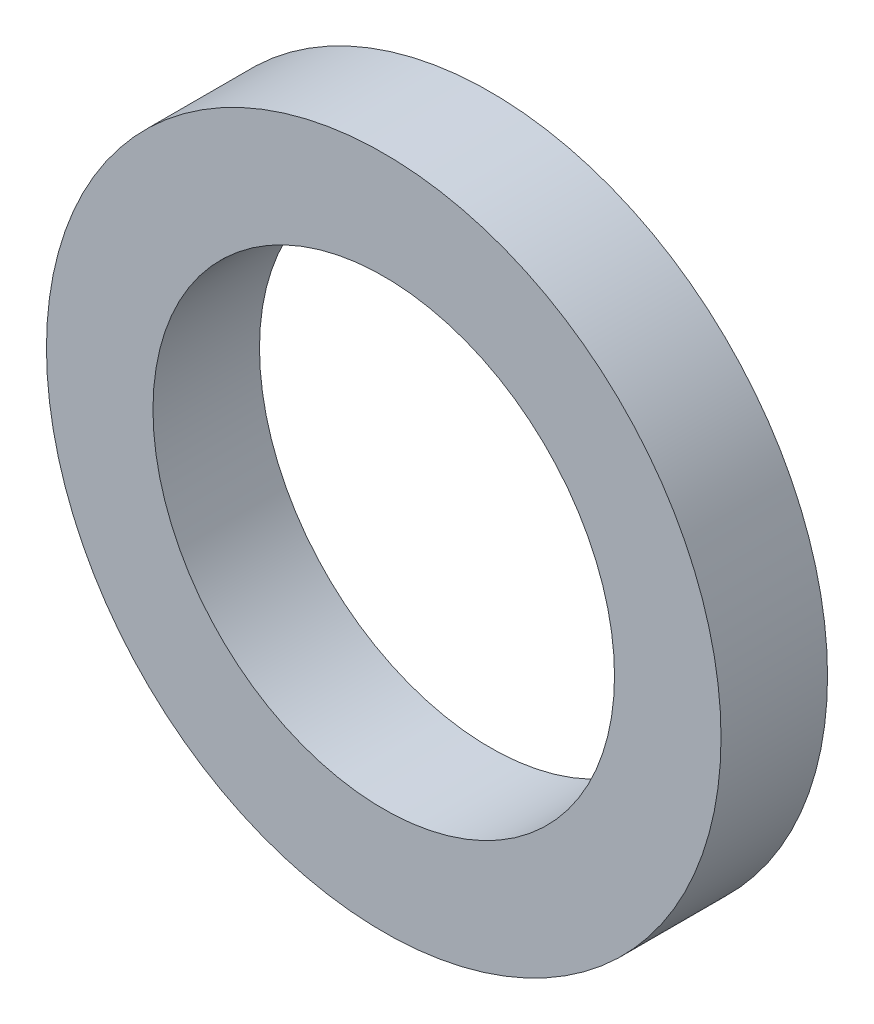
ISO-10303-21;
HEADER;
FILE_DESCRIPTION(('STEP AP214'),'2;1');
FILE_NAME('part.step','',(''),(''),'','','');
FILE_SCHEMA(('AUTOMOTIVE_DESIGN { 1 0 10303 214 1 1 1 1 }'));
ENDSEC;
DATA;
#1=APPLICATION_CONTEXT('core data for automotive mechanical design processes');
#2=APPLICATION_PROTOCOL_DEFINITION('international standard','automotive_design',2000,#1);
#3=PRODUCT_CONTEXT('',#1,'mechanical');
#4=PRODUCT('Part','Part','',(#3));
#5=PRODUCT_RELATED_PRODUCT_CATEGORY('part','',(#4));
#6=PRODUCT_DEFINITION_FORMATION('','',#4);
#7=PRODUCT_DEFINITION_CONTEXT('part definition',#1,'design');
#8=PRODUCT_DEFINITION('design','',#6,#7);
#9=PRODUCT_DEFINITION_SHAPE('','',#8);
#10=(LENGTH_UNIT() NAMED_UNIT(*) SI_UNIT(.MILLI.,.METRE.));
#11=(NAMED_UNIT(*) PLANE_ANGLE_UNIT() SI_UNIT($,.RADIAN.));
#12=(NAMED_UNIT(*) SI_UNIT($,.STERADIAN.) SOLID_ANGLE_UNIT());
#13=UNCERTAINTY_MEASURE_WITH_UNIT(LENGTH_MEASURE(1.E-05),#10,'distance_accuracy_value','');
#14=(GEOMETRIC_REPRESENTATION_CONTEXT(3) GLOBAL_UNCERTAINTY_ASSIGNED_CONTEXT((#13)) GLOBAL_UNIT_ASSIGNED_CONTEXT((#10,
#11,#12)) REPRESENTATION_CONTEXT('',''));
#15=CARTESIAN_POINT('',(0.,0.,0.));
#16=DIRECTION('',(0.,0.,1.));
#17=DIRECTION('',(1.,0.,0.));
#18=AXIS2_PLACEMENT_3D('',#15,#16,#17);
#19=CARTESIAN_POINT('',(0.,0.,3.));
#20=DIRECTION('',(0.,0.,1.));
#21=DIRECTION('',(1.,0.,0.));
#22=AXIS2_PLACEMENT_3D('',#19,#20,#21);
#23=PLANE('',#22);
#24=CARTESIAN_POINT('',(0.,0.,3.));
#25=DIRECTION('',(0.,0.,1.));
#26=DIRECTION('',(1.,0.,0.));
#27=AXIS2_PLACEMENT_3D('',#24,#25,#26);
#28=CIRCLE('',#27,9.5);
#29=CARTESIAN_POINT('',(9.5,0.,3.));
#30=VERTEX_POINT('',#29);
#31=EDGE_CURVE('E8',#30,#30,#28,.T.);
#32=ORIENTED_EDGE('',*,*,#31,.T.);
#33=EDGE_LOOP('',(#32));
#34=FACE_BOUND('',#33,.T.);
#35=CARTESIAN_POINT('',(0.,0.,3.));
#36=DIRECTION('',(0.,0.,1.));
#37=DIRECTION('',(1.,0.,0.));
#38=AXIS2_PLACEMENT_3D('',#35,#36,#37);
#39=CIRCLE('',#38,6.5);
#40=CARTESIAN_POINT('',(6.5,0.,3.));
#41=VERTEX_POINT('',#40);
#42=EDGE_CURVE('E23',#41,#41,#39,.T.);
#43=ORIENTED_EDGE('',*,*,#42,.F.);
#44=EDGE_LOOP('',(#43));
#45=FACE_BOUND('',#44,.T.);
#46=ADVANCED_FACE('F12',(#34,#45),#23,.T.);
#47=CARTESIAN_POINT('',(0.,0.,0.));
#48=DIRECTION('',(0.,0.,1.));
#49=DIRECTION('',(1.,0.,0.));
#50=AXIS2_PLACEMENT_3D('',#47,#48,#49);
#51=PLANE('',#50);
#52=CARTESIAN_POINT('',(0.,0.,0.));
#53=DIRECTION('',(0.,0.,1.));
#54=DIRECTION('',(1.,0.,0.));
#55=AXIS2_PLACEMENT_3D('',#52,#53,#54);
#56=CIRCLE('',#55,9.5);
#57=CARTESIAN_POINT('',(9.5,0.,0.));
#58=VERTEX_POINT('',#57);
#59=EDGE_CURVE('E19',#58,#58,#56,.T.);
#60=ORIENTED_EDGE('',*,*,#59,.F.);
#61=EDGE_LOOP('',(#60));
#62=FACE_BOUND('',#61,.T.);
#63=CARTESIAN_POINT('',(0.,0.,0.));
#64=DIRECTION('',(0.,0.,1.));
#65=DIRECTION('',(1.,0.,0.));
#66=AXIS2_PLACEMENT_3D('',#63,#64,#65);
#67=CIRCLE('',#66,6.5);
#68=CARTESIAN_POINT('',(6.5,0.,0.));
#69=VERTEX_POINT('',#68);
#70=EDGE_CURVE('E27',#69,#69,#67,.T.);
#71=ORIENTED_EDGE('',*,*,#70,.T.);
#72=EDGE_LOOP('',(#71));
#73=FACE_BOUND('',#72,.T.);
#74=ADVANCED_FACE('F33',(#62,#73),#51,.F.);
#75=CARTESIAN_POINT('',(0.,0.,3.));
#76=DIRECTION('',(0.,0.,-1.));
#77=DIRECTION('',(-1.,0.,0.));
#78=AXIS2_PLACEMENT_3D('',#75,#76,#77);
#79=CYLINDRICAL_SURFACE('',#78,9.5);
#80=ORIENTED_EDGE('',*,*,#31,.F.);
#81=EDGE_LOOP('',(#80));
#82=FACE_BOUND('',#81,.T.);
#83=ORIENTED_EDGE('',*,*,#59,.T.);
#84=EDGE_LOOP('',(#83));
#85=FACE_BOUND('',#84,.T.);
#86=ADVANCED_FACE('F14',(#82,#85),#79,.T.);
#87=CARTESIAN_POINT('',(0.,0.,3.));
#88=DIRECTION('',(0.,0.,-1.));
#89=DIRECTION('',(-1.,0.,0.));
#90=AXIS2_PLACEMENT_3D('',#87,#88,#89);
#91=CYLINDRICAL_SURFACE('',#90,6.5);
#92=ORIENTED_EDGE('',*,*,#42,.T.);
#93=EDGE_LOOP('',(#92));
#94=FACE_BOUND('',#93,.T.);
#95=ORIENTED_EDGE('',*,*,#70,.F.);
#96=EDGE_LOOP('',(#95));
#97=FACE_BOUND('',#96,.T.);
#98=ADVANCED_FACE('F35',(#94,#97),#91,.F.);
#99=CLOSED_SHELL('',(#46,#74,#86,#98));
#100=MANIFOLD_SOLID_BREP('B1',#99);
#101=ADVANCED_BREP_SHAPE_REPRESENTATION('',(#18,#100),#14);
#102=SHAPE_DEFINITION_REPRESENTATION(#9,#101);
ENDSEC;
END-ISO-10303-21;
